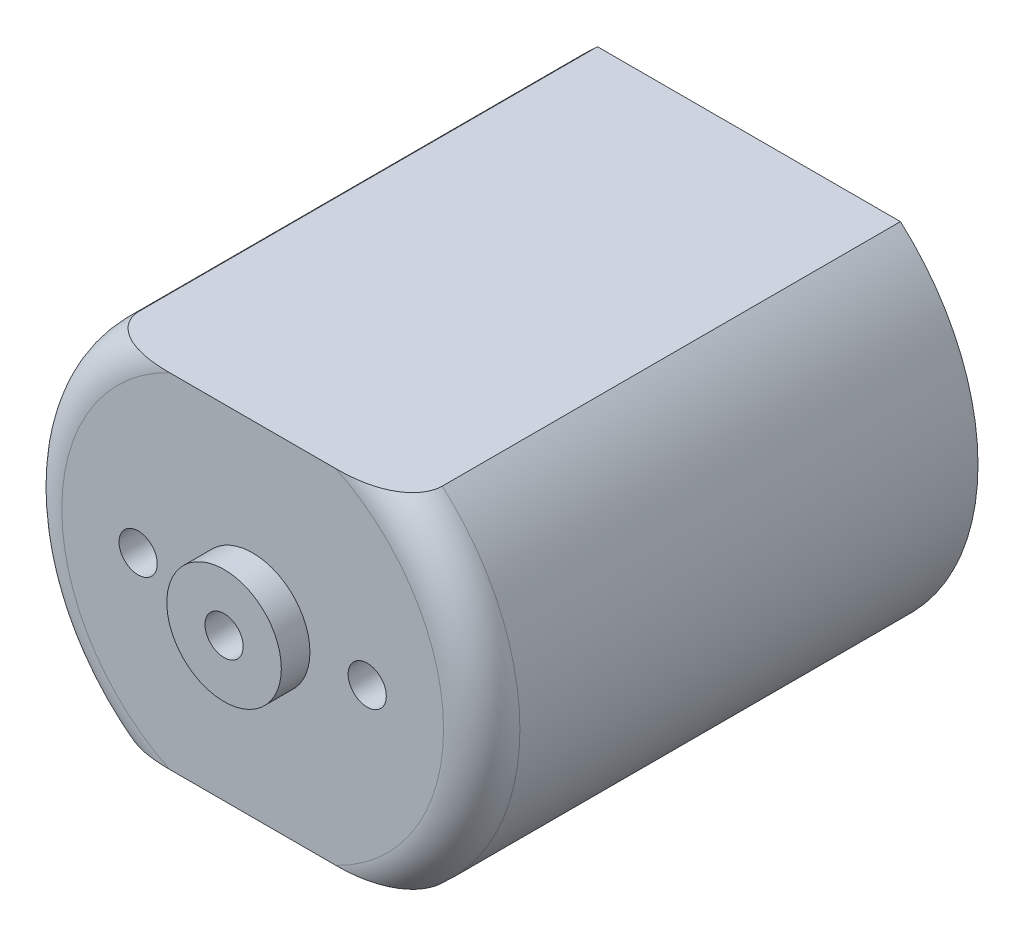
from build123d import *

# Parameters (mm, degrees)
ESQUISSE1_R               = 12
CYLINDRE_DE_BASE_DEPTH    = 13
CONG_1_R                  = 2
ESQUISSE2_OUTSIDE_W       = 34.552
ESQUISSE2_OUTSIDE_H       = 34.552
ESQUISSE2_OUTSIDE_W_2     = 24
ESQUISSE2_OUTSIDE_H_2     = 18
M_PLATS_DEPTH             = 32.048349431
ESQUISSE3_R               = 3
BOSSAGE_AVANT_DEPTH       = 1.5
ESQUISSE4_R               = 1
TROU_ARBRE_DEPTH          = 3
BOSSAGE_START             = 3
ESQUISSE5_R               = 3
BOSSAGE_ARRI_RE_DEPTH     = 3
ESQUISSE6_R               = 1
TROU_FIXATION_DEPTH       = 3
R_P_TITION_FIXATION_COUNT = 2


with BuildPart() as part:
    # Esquisse1 → Cylindre de base (new, symmetric)
    with BuildSketch(Plane.XY):
        Circle(ESQUISSE1_R)
    extrude(amount=CYLINDRE_DE_BASE_DEPTH, both=True)

    # Cong_1
    cong_1_edges = [part.edges().sort_by_distance(p)[0] for p in [
        (-12, 0, 13),
    ]]
    fillet(cong_1_edges, radius=CONG_1_R)

    # Esquisse2 outside → M_plats (cut, through all)
    with BuildSketch(Plane(origin=(0, 0, -13), x_dir=(-1, 0, 0), z_dir=(0, 0, -1))):
        Rectangle(ESQUISSE2_OUTSIDE_W, ESQUISSE2_OUTSIDE_H)
        Rectangle(ESQUISSE2_OUTSIDE_W_2, ESQUISSE2_OUTSIDE_H_2, mode=Mode.SUBTRACT)
    extrude(amount=-M_PLATS_DEPTH, mode=Mode.SUBTRACT)

    # Esquisse3 → Bossage avant (add)
    with BuildSketch(Plane.XY.offset(13)):
        Circle(ESQUISSE3_R)
    extrude(amount=BOSSAGE_AVANT_DEPTH)

    # Esquisse4 → Trou arbre (cut)
    with BuildSketch(Plane.XY.offset(14.5)):
        Circle(ESQUISSE4_R)
    extrude(amount=-TROU_ARBRE_DEPTH, mode=Mode.SUBTRACT)

    # Esquisse5 → Bossage arri_re (add)
    with BuildSketch(Plane(origin=(0, 0, -13), x_dir=(-1, 0, 0), z_dir=(0, 0, -1)).offset(BOSSAGE_START)):
        with Locations(Location((0, 0, 0), (0, 0, 180))):
            Circle(ESQUISSE5_R)
    extrude(amount=-BOSSAGE_ARRI_RE_DEPTH)

    # Esquisse6 → Trou fixation (cut)
    with BuildSketch(Plane.XY.offset(13)):
        with Locations((6, 0)):
            Circle(ESQUISSE6_R)
    trou_fixation = extrude(amount=-TROU_FIXATION_DEPTH, mode=Mode.SUBTRACT)

    # R_p_tition fixation: Trou fixation ×2 about axis
    r_p_tition_fixation_axis = Axis((0, 0, 0), (0, 0, 1))
    for i in range(1, R_P_TITION_FIXATION_COUNT):
        add(trou_fixation.rotate(r_p_tition_fixation_axis, i * 360 / R_P_TITION_FIXATION_COUNT), mode=Mode.SUBTRACT)


solid = part.part
